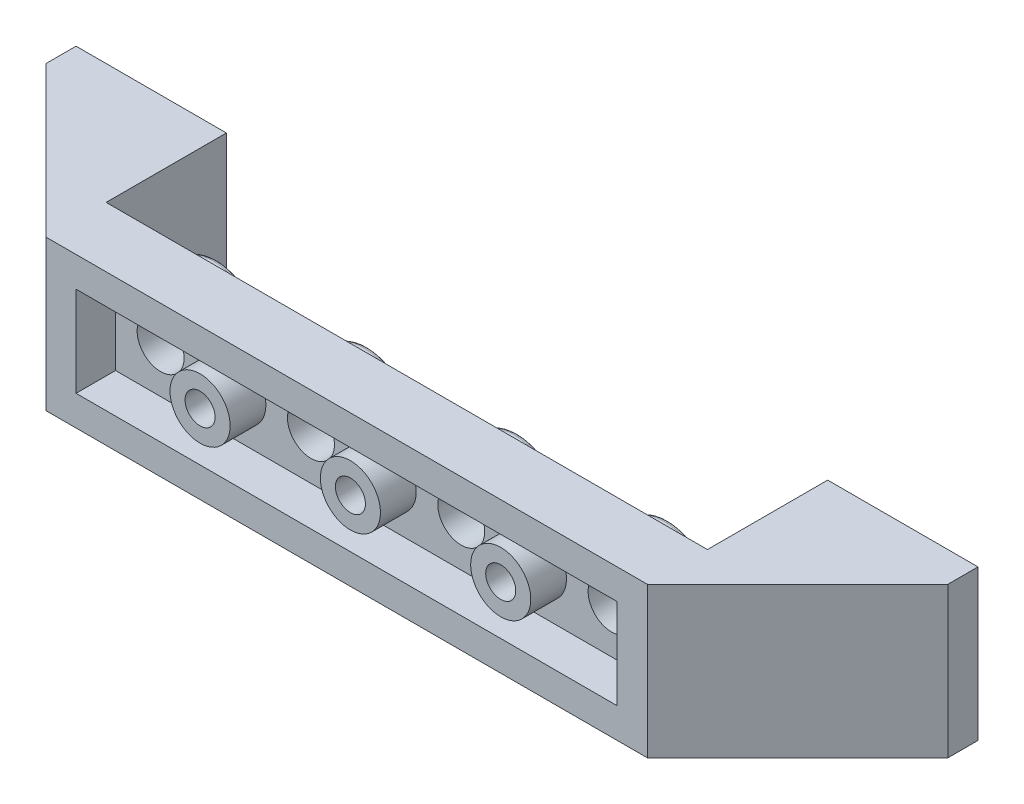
from build123d import *

# Parameters (mm, degrees)
SKIZZE1_W                         = 32
SKIZZE1_H                         = 8
LINEAR_AUSTRAGEN1_DEPTH           = 3.2
SKIZZE2_W                         = 28.8
SKIZZE2_H                         = 4.8
SCHNITT_LINEAR_AUSTRAGEN1_DEPTH   = 2.1
SKIZZE3_R                         = 1.6
SKIZZE3_R_2                       = 0.8
LINEAR_AUSTRAGEN2_DEPTH           = 1.9
SKIZZE4_R                         = 2.45
LINEAR_AUSTRAGEN3_DEPTH           = 1.9
VERRUNDUNG1_R                     = 0.2
SKIZZE9_R                         = 1.25
SCHNITT_LINEAR_AUSTRAGEN2_DEPTH   = 1.8
LINEARES_MUSTER2_COUNT            = 3
LINEARES_MUSTER2_PITCH            = 8
LINEARES_MUSTER3_COUNT            = 4
LINEARES_MUSTER3_PITCH            = 8
VERRUNDUNG1_OF_LINEARES_MUSTER3_R = 0.2
LINEAR_AUSTRAGEN4_DEPTH           = 8
SKIZZE11_R                        = 2.45
SKIZZE11_R_2                      = 1.6
LINEAR_AUSTRAGEN5_DEPTH           = 1.5


with BuildPart() as part:
    # Skizze1 → Linear austragen1 (new body)
    with BuildSketch(Plane.XY):
        with Locations((-16, -4)):
            Rectangle(SKIZZE1_W, SKIZZE1_H)
    extrude(amount=LINEAR_AUSTRAGEN1_DEPTH)

    # Skizze2 → Schnitt-Linear austragen1 (cut)
    with BuildSketch(Plane.XY.offset(3.2)):
        with Locations((-16, -4)):
            Rectangle(SKIZZE2_W, SKIZZE2_H)
    extrude(amount=-SCHNITT_LINEAR_AUSTRAGEN1_DEPTH, mode=Mode.SUBTRACT)

    # Skizze3 → Linear austragen2 (add)
    with BuildSketch(Plane.XY.offset(1.1)):
        with Locations(Location((-8, -4, 0), (0, 0, 180))):
            Circle(SKIZZE3_R)
        with Locations(Location((-8, -4, 0), (0, 0, 180))):
            Circle(SKIZZE3_R_2, mode=Mode.SUBTRACT)
    linear_austragen2 = extrude(amount=LINEAR_AUSTRAGEN2_DEPTH)

    # Skizze4 → Linear austragen3 (add)
    with BuildSketch(Plane(origin=(0, 0, 0), x_dir=(-1, 0, 0), z_dir=(0, 0, -1))):
        with Locations(Location((4, -4, 0), (0, 0, 180))):
            Circle(SKIZZE4_R)
    linear_austragen3 = extrude(amount=LINEAR_AUSTRAGEN3_DEPTH)

    # Verrundung1
    verrundung1_edges = [part.edges().sort_by_distance(p)[0] for p in [
        (-6.45, -4, -1.9),
    ]]
    fillet(verrundung1_edges, radius=VERRUNDUNG1_R)

    # Skizze9 → Schnitt-Linear austragen2 (cut)
    with BuildSketch(Plane.XY.offset(1.1)):
        with Locations((-4, -4)):
            Circle(SKIZZE9_R)
    schnitt_linear_austragen2 = extrude(amount=-SCHNITT_LINEAR_AUSTRAGEN2_DEPTH, mode=Mode.SUBTRACT)

    # Lineares Muster2: Linear austragen2 ×3
    with Locations(*[(-i * LINEARES_MUSTER2_PITCH, 0, 0) for i in range(1, LINEARES_MUSTER2_COUNT)]):
        add(linear_austragen2)

    # Lineares Muster3: Linear austragen3, Schnitt-Linear austragen2 ×4
    with Locations(*[(-i * LINEARES_MUSTER3_PITCH, 0, 0) for i in range(1, LINEARES_MUSTER3_COUNT)]):
        add(linear_austragen3)
        add(schnitt_linear_austragen2, mode=Mode.SUBTRACT)

    # Verrundung1 of Lineares Muster3
    verrundung1_of_lineares_muster3_edges = [part.edges().sort_by_distance(p)[0] for p in [
        (-14.45, -4, -1.9),
        (-22.45, -4, -1.9),
        (-30.45, -4, -1.9),
    ]]
    fillet(verrundung1_of_lineares_muster3_edges, radius=VERRUNDUNG1_OF_LINEARES_MUSTER3_R)

    # Skizze10 → Linear austragen4 (add)
    with BuildSketch(Plane(origin=(0, 0, 0), x_dir=(-1, 0, 0), z_dir=(0, 1, 0))):
        Polygon((0, 0), (0, -6.4), (-8, -6.4), (-8, -4.8), (0, 3.2), align=None)
        Polygon((32, 3.2), (32, 0), (32, -6.4), (40, -6.4), (40, -4.8), align=None)
    extrude(amount=-LINEAR_AUSTRAGEN4_DEPTH)

    # Skizze11 → Linear austragen5 (add)
    # profile 1 of 2: a face of its own
    with BuildSketch(Plane(origin=(0, 0, -6.4), x_dir=(-1, 0, 0), z_dir=(0, 0, -1))):
        with Locations((-4, -4)):
            Circle(SKIZZE11_R)
        with Locations((-4, -4)):
            Circle(SKIZZE11_R_2, mode=Mode.SUBTRACT)
    # profile 2 of 2: a face of its own
    with BuildSketch(Plane(origin=(0, 0, -6.4), x_dir=(-1, 0, 0), z_dir=(0, 0, -1))):
        with Locations(Location((36, -4, 0), (0, 0, 180))):
            Circle(SKIZZE11_R)
        with Locations(Location((36, -4, 0), (0, 0, 180))):
            Circle(SKIZZE11_R_2, mode=Mode.SUBTRACT)
    extrude(amount=LINEAR_AUSTRAGEN5_DEPTH)


solid = part.part
